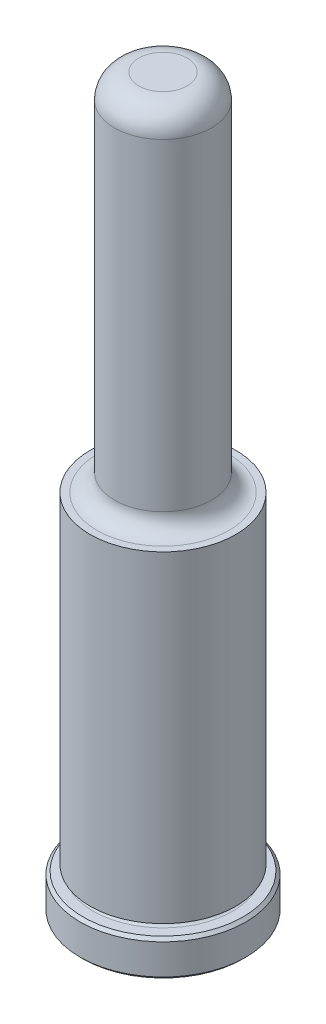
ISO-10303-21;
HEADER;
FILE_DESCRIPTION(('STEP AP214'),'2;1');
FILE_NAME('part.step','',(''),(''),'','','');
FILE_SCHEMA(('AUTOMOTIVE_DESIGN { 1 0 10303 214 1 1 1 1 }'));
ENDSEC;
DATA;
#1=APPLICATION_CONTEXT('core data for automotive mechanical design processes');
#2=APPLICATION_PROTOCOL_DEFINITION('international standard','automotive_design',2000,#1);
#3=PRODUCT_CONTEXT('',#1,'mechanical');
#4=PRODUCT('Part','Part','',(#3));
#5=PRODUCT_RELATED_PRODUCT_CATEGORY('part','',(#4));
#6=PRODUCT_DEFINITION_FORMATION('','',#4);
#7=PRODUCT_DEFINITION_CONTEXT('part definition',#1,'design');
#8=PRODUCT_DEFINITION('design','',#6,#7);
#9=PRODUCT_DEFINITION_SHAPE('','',#8);
#10=(LENGTH_UNIT() NAMED_UNIT(*) SI_UNIT(.MILLI.,.METRE.));
#11=(NAMED_UNIT(*) PLANE_ANGLE_UNIT() SI_UNIT($,.RADIAN.));
#12=(NAMED_UNIT(*) SI_UNIT($,.STERADIAN.) SOLID_ANGLE_UNIT());
#13=UNCERTAINTY_MEASURE_WITH_UNIT(LENGTH_MEASURE(1.E-05),#10,'distance_accuracy_value','');
#14=(GEOMETRIC_REPRESENTATION_CONTEXT(3) GLOBAL_UNCERTAINTY_ASSIGNED_CONTEXT((#13)) GLOBAL_UNIT_ASSIGNED_CONTEXT((#10,
#11,#12)) REPRESENTATION_CONTEXT('',''));
#15=CARTESIAN_POINT('',(0.,0.,0.));
#16=DIRECTION('',(0.,0.,1.));
#17=DIRECTION('',(1.,0.,0.));
#18=AXIS2_PLACEMENT_3D('',#15,#16,#17);
#19=CARTESIAN_POINT('',(0.,0.,0.));
#20=DIRECTION('',(0.,1.,0.));
#21=DIRECTION('',(0.,0.,1.));
#22=AXIS2_PLACEMENT_3D('',#19,#20,#21);
#23=PLANE('',#22);
#24=CARTESIAN_POINT('',(0.,0.,0.));
#25=DIRECTION('',(0.,1.,0.));
#26=DIRECTION('',(0.,0.,1.));
#27=AXIS2_PLACEMENT_3D('',#24,#25,#26);
#28=CIRCLE('',#27,10.4521);
#29=CARTESIAN_POINT('',(0.,0.,10.4521));
#30=VERTEX_POINT('',#29);
#31=EDGE_CURVE('E46',#30,#30,#28,.F.);
#32=ORIENTED_EDGE('',*,*,#31,.T.);
#33=EDGE_LOOP('',(#32));
#34=FACE_BOUND('',#33,.T.);
#35=ADVANCED_FACE('F31',(#34),#23,.F.);
#36=CARTESIAN_POINT('',(0.,0.,0.));
#37=DIRECTION('',(0.,1.,0.));
#38=DIRECTION('',(0.,0.,1.));
#39=AXIS2_PLACEMENT_3D('',#36,#37,#38);
#40=CYLINDRICAL_SURFACE('',#39,10.8331);
#41=CARTESIAN_POINT('',(0.,0.380999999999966,0.));
#42=DIRECTION('',(0.,1.,0.));
#43=DIRECTION('',(0.,0.,1.));
#44=AXIS2_PLACEMENT_3D('',#41,#42,#43);
#45=CIRCLE('',#44,10.8331);
#46=CARTESIAN_POINT('',(0.,0.380999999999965,10.8331));
#47=VERTEX_POINT('',#46);
#48=EDGE_CURVE('E51',#47,#47,#45,.T.);
#49=ORIENTED_EDGE('',*,*,#48,.T.);
#50=EDGE_LOOP('',(#49));
#51=FACE_BOUND('',#50,.T.);
#52=CARTESIAN_POINT('',(0.,4.36879999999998,0.));
#53=DIRECTION('',(0.,-1.,0.));
#54=DIRECTION('',(0.,0.,-1.));
#55=AXIS2_PLACEMENT_3D('',#52,#53,#54);
#56=CIRCLE('',#55,10.8331);
#57=CARTESIAN_POINT('',(0.,4.36879999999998,-10.8331));
#58=VERTEX_POINT('',#57);
#59=EDGE_CURVE('E54',#58,#58,#56,.T.);
#60=ORIENTED_EDGE('',*,*,#59,.T.);
#61=EDGE_LOOP('',(#60));
#62=FACE_BOUND('',#61,.T.);
#63=ADVANCED_FACE('F110',(#51,#62),#40,.T.);
#64=CARTESIAN_POINT('',(0.,4.7498,-10.8331));
#65=DIRECTION('',(0.,-1.,0.));
#66=DIRECTION('',(0.,0.,-1.));
#67=AXIS2_PLACEMENT_3D('',#64,#65,#66);
#68=PLANE('',#67);
#69=CARTESIAN_POINT('',(0.,4.7498,0.));
#70=DIRECTION('',(0.,-1.,0.));
#71=DIRECTION('',(0.,0.,-1.));
#72=AXIS2_PLACEMENT_3D('',#69,#70,#71);
#73=CIRCLE('',#72,10.4521);
#74=CARTESIAN_POINT('',(0.,4.7498,-10.4521));
#75=VERTEX_POINT('',#74);
#76=EDGE_CURVE('E42',#75,#75,#73,.F.);
#77=ORIENTED_EDGE('',*,*,#76,.T.);
#78=EDGE_LOOP('',(#77));
#79=FACE_BOUND('',#78,.T.);
#80=CARTESIAN_POINT('',(0.,4.7498,0.));
#81=DIRECTION('',(0.,1.,0.));
#82=DIRECTION('',(0.,0.,1.));
#83=AXIS2_PLACEMENT_3D('',#80,#81,#82);
#84=CIRCLE('',#83,9.13129999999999);
#85=CARTESIAN_POINT('',(0.,4.7498,9.13129999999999));
#86=VERTEX_POINT('',#85);
#87=EDGE_CURVE('E57',#86,#86,#84,.T.);
#88=ORIENTED_EDGE('',*,*,#87,.F.);
#89=EDGE_LOOP('',(#88));
#90=FACE_BOUND('',#89,.T.);
#91=ADVANCED_FACE('F105',(#79,#90),#68,.F.);
#92=CARTESIAN_POINT('',(0.,5.1308,0.));
#93=DIRECTION('',(0.,1.,0.));
#94=DIRECTION('',(0.,0.,1.));
#95=AXIS2_PLACEMENT_3D('',#92,#93,#94);
#96=TOROIDAL_SURFACE('',#95,9.13129999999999,0.381);
#97=CARTESIAN_POINT('',(0.,5.5118,0.));
#98=DIRECTION('',(0.,1.,0.));
#99=DIRECTION('',(0.,0.,1.));
#100=AXIS2_PLACEMENT_3D('',#97,#98,#99);
#101=CIRCLE('',#100,9.13129999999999);
#102=CARTESIAN_POINT('',(0.,5.5118,9.13129999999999));
#103=VERTEX_POINT('',#102);
#104=EDGE_CURVE('E60',#103,#103,#101,.T.);
#105=ORIENTED_EDGE('',*,*,#104,.F.);
#106=EDGE_LOOP('',(#105));
#107=FACE_BOUND('',#106,.T.);
#108=ORIENTED_EDGE('',*,*,#87,.T.);
#109=EDGE_LOOP('',(#108));
#110=FACE_BOUND('',#109,.T.);
#111=ADVANCED_FACE('F99',(#107,#110),#96,.F.);
#112=CARTESIAN_POINT('',(0.,5.5118,-9.13129999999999));
#113=DIRECTION('',(0.,1.,0.));
#114=DIRECTION('',(0.,0.,1.));
#115=AXIS2_PLACEMENT_3D('',#112,#113,#114);
#116=PLANE('',#115);
#117=CARTESIAN_POINT('',(0.,5.5118,0.));
#118=DIRECTION('',(0.,1.,0.));
#119=DIRECTION('',(0.,0.,1.));
#120=AXIS2_PLACEMENT_3D('',#117,#118,#119);
#121=CIRCLE('',#120,9.53769999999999);
#122=CARTESIAN_POINT('',(0.,5.5118,9.53769999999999));
#123=VERTEX_POINT('',#122);
#124=EDGE_CURVE('E63',#123,#123,#121,.T.);
#125=ORIENTED_EDGE('',*,*,#124,.F.);
#126=EDGE_LOOP('',(#125));
#127=FACE_BOUND('',#126,.T.);
#128=ORIENTED_EDGE('',*,*,#104,.T.);
#129=EDGE_LOOP('',(#128));
#130=FACE_BOUND('',#129,.T.);
#131=ADVANCED_FACE('F93',(#127,#130),#116,.F.);
#132=CARTESIAN_POINT('',(0.,0.,0.));
#133=DIRECTION('',(0.,1.,0.));
#134=DIRECTION('',(0.,0.,1.));
#135=AXIS2_PLACEMENT_3D('',#132,#133,#134);
#136=CYLINDRICAL_SURFACE('',#135,9.53769999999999);
#137=CARTESIAN_POINT('',(0.,47.625,0.));
#138=DIRECTION('',(0.,1.,0.));
#139=DIRECTION('',(0.,0.,1.));
#140=AXIS2_PLACEMENT_3D('',#137,#138,#139);
#141=CIRCLE('',#140,9.53769999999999);
#142=CARTESIAN_POINT('',(0.,47.625,9.5377));
#143=VERTEX_POINT('',#142);
#144=EDGE_CURVE('E66',#143,#143,#141,.T.);
#145=ORIENTED_EDGE('',*,*,#144,.F.);
#146=EDGE_LOOP('',(#145));
#147=FACE_BOUND('',#146,.T.);
#148=ORIENTED_EDGE('',*,*,#124,.T.);
#149=EDGE_LOOP('',(#148));
#150=FACE_BOUND('',#149,.T.);
#151=ADVANCED_FACE('F87',(#147,#150),#136,.T.);
#152=CARTESIAN_POINT('',(0.,47.625,-9.53769999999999));
#153=DIRECTION('',(0.,-1.,0.));
#154=DIRECTION('',(0.,0.,-1.));
#155=AXIS2_PLACEMENT_3D('',#152,#153,#154);
#156=PLANE('',#155);
#157=CARTESIAN_POINT('',(0.,47.625,0.));
#158=DIRECTION('',(0.,1.,0.));
#159=DIRECTION('',(0.,0.,1.));
#160=AXIS2_PLACEMENT_3D('',#157,#158,#159);
#161=CIRCLE('',#160,8.6233);
#162=CARTESIAN_POINT('',(0.,47.625,8.62330000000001));
#163=VERTEX_POINT('',#162);
#164=EDGE_CURVE('E69',#163,#163,#161,.T.);
#165=ORIENTED_EDGE('',*,*,#164,.F.);
#166=EDGE_LOOP('',(#165));
#167=FACE_BOUND('',#166,.T.);
#168=ORIENTED_EDGE('',*,*,#144,.T.);
#169=EDGE_LOOP('',(#168));
#170=FACE_BOUND('',#169,.T.);
#171=ADVANCED_FACE('F81',(#167,#170),#156,.F.);
#172=CARTESIAN_POINT('',(0.,49.911,0.));
#173=DIRECTION('',(0.,1.,0.));
#174=DIRECTION('',(0.,0.,1.));
#175=AXIS2_PLACEMENT_3D('',#172,#173,#174);
#176=TOROIDAL_SURFACE('',#175,8.6233,2.286);
#177=CARTESIAN_POINT('',(0.,49.911,0.));
#178=DIRECTION('',(0.,1.,0.));
#179=DIRECTION('',(0.,0.,1.));
#180=AXIS2_PLACEMENT_3D('',#177,#178,#179);
#181=CIRCLE('',#180,6.3373);
#182=CARTESIAN_POINT('',(0.,49.911,6.33730000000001));
#183=VERTEX_POINT('',#182);
#184=EDGE_CURVE('E72',#183,#183,#181,.T.);
#185=ORIENTED_EDGE('',*,*,#184,.F.);
#186=EDGE_LOOP('',(#185));
#187=FACE_BOUND('',#186,.T.);
#188=ORIENTED_EDGE('',*,*,#164,.T.);
#189=EDGE_LOOP('',(#188));
#190=FACE_BOUND('',#189,.T.);
#191=ADVANCED_FACE('F78',(#187,#190),#176,.F.);
#192=CARTESIAN_POINT('',(0.,0.,0.));
#193=DIRECTION('',(0.,1.,0.));
#194=DIRECTION('',(0.,0.,1.));
#195=AXIS2_PLACEMENT_3D('',#192,#193,#194);
#196=CYLINDRICAL_SURFACE('',#195,6.3373);
#197=CARTESIAN_POINT('',(0.,92.075,0.));
#198=DIRECTION('',(0.,-1.,0.));
#199=DIRECTION('',(0.,0.,-1.));
#200=AXIS2_PLACEMENT_3D('',#197,#198,#199);
#201=CIRCLE('',#200,6.3373);
#202=CARTESIAN_POINT('',(0.,92.075,-6.33729999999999));
#203=VERTEX_POINT('',#202);
#204=EDGE_CURVE('E10',#203,#203,#201,.T.);
#205=ORIENTED_EDGE('',*,*,#204,.T.);
#206=EDGE_LOOP('',(#205));
#207=FACE_BOUND('',#206,.T.);
#208=ORIENTED_EDGE('',*,*,#184,.T.);
#209=EDGE_LOOP('',(#208));
#210=FACE_BOUND('',#209,.T.);
#211=ADVANCED_FACE('F76',(#207,#210),#196,.T.);
#212=CARTESIAN_POINT('',(0.,95.25,-6.33729999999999));
#213=DIRECTION('',(0.,-1.,0.));
#214=DIRECTION('',(0.,0.,-1.));
#215=AXIS2_PLACEMENT_3D('',#212,#213,#214);
#216=PLANE('',#215);
#217=CARTESIAN_POINT('',(0.,95.25,0.));
#218=DIRECTION('',(0.,-1.,0.));
#219=DIRECTION('',(0.,0.,-1.));
#220=AXIS2_PLACEMENT_3D('',#217,#218,#219);
#221=CIRCLE('',#220,3.1623);
#222=CARTESIAN_POINT('',(0.,95.25,-3.16229999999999));
#223=VERTEX_POINT('',#222);
#224=EDGE_CURVE('E38',#223,#223,#221,.F.);
#225=ORIENTED_EDGE('',*,*,#224,.T.);
#226=EDGE_LOOP('',(#225));
#227=FACE_BOUND('',#226,.T.);
#228=ADVANCED_FACE('F127',(#227),#216,.F.);
#229=CARTESIAN_POINT('',(0.,0.380999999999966,0.));
#230=DIRECTION('',(0.,1.,0.));
#231=DIRECTION('',(0.,0.,1.));
#232=AXIS2_PLACEMENT_3D('',#229,#230,#231);
#233=CONICAL_SURFACE('',#232,10.8331,0.785398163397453);
#234=ORIENTED_EDGE('',*,*,#31,.F.);
#235=EDGE_LOOP('',(#234));
#236=FACE_BOUND('',#235,.T.);
#237=ORIENTED_EDGE('',*,*,#48,.F.);
#238=EDGE_LOOP('',(#237));
#239=FACE_BOUND('',#238,.T.);
#240=ADVANCED_FACE('F124',(#236,#239),#233,.T.);
#241=CARTESIAN_POINT('',(0.,4.7498,0.));
#242=DIRECTION('',(0.,-1.,0.));
#243=DIRECTION('',(0.,0.,-1.));
#244=AXIS2_PLACEMENT_3D('',#241,#242,#243);
#245=CONICAL_SURFACE('',#244,10.4521,0.785398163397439);
#246=ORIENTED_EDGE('',*,*,#59,.F.);
#247=EDGE_LOOP('',(#246));
#248=FACE_BOUND('',#247,.T.);
#249=ORIENTED_EDGE('',*,*,#76,.F.);
#250=EDGE_LOOP('',(#249));
#251=FACE_BOUND('',#250,.T.);
#252=ADVANCED_FACE('F126',(#248,#251),#245,.T.);
#253=CARTESIAN_POINT('',(0.,92.075,0.));
#254=DIRECTION('',(0.,-1.,0.));
#255=DIRECTION('',(0.,0.,-1.));
#256=AXIS2_PLACEMENT_3D('',#253,#254,#255);
#257=DEGENERATE_TOROIDAL_SURFACE('',#256,3.1623,3.175,.T.);
#258=ORIENTED_EDGE('',*,*,#204,.F.);
#259=EDGE_LOOP('',(#258));
#260=FACE_BOUND('',#259,.T.);
#261=ORIENTED_EDGE('',*,*,#224,.F.);
#262=EDGE_LOOP('',(#261));
#263=FACE_BOUND('',#262,.T.);
#264=ADVANCED_FACE('F33',(#260,#263),#257,.T.);
#265=CLOSED_SHELL('',(#35,#63,#91,#111,#131,#151,#171,#191,#211,#228,#240,#252,#264));
#266=MANIFOLD_SOLID_BREP('B2',#265);
#267=ADVANCED_BREP_SHAPE_REPRESENTATION('',(#18,#266),#14);
#268=SHAPE_DEFINITION_REPRESENTATION(#9,#267);
ENDSEC;
END-ISO-10303-21;
